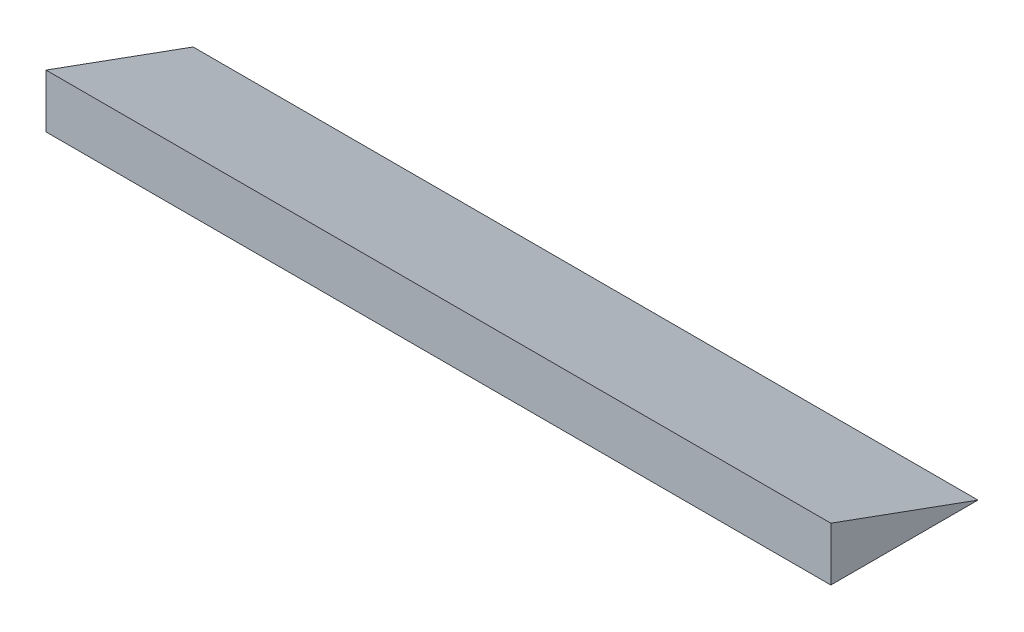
from build123d import *

# Parameters (mm, degrees)
BOSS_EXTRU_1_DEPTH      = 1600
ESQUISSE2_R             = 5
ENL_V_MAT_EXTRU_1_DEPTH = 10


with BuildPart() as part:
    # Esquisse1 → Boss.-Extru.1 (new body)
    with BuildSketch(Plane(origin=(0, 0, 0), x_dir=(0, 0, -1), z_dir=(1, 0, 0))):
        Polygon((0, 0), (300, 0), (0, 109.19107028), align=None)
    extrude(amount=BOSS_EXTRU_1_DEPTH)

    # Esquisse2 → Enl_v. mat.-Extru.1 (cut)
    with BuildSketch(Plane.XZ):
        with Locations(Location((550, -150, 0), (0, 0, 270))):
            Circle(ESQUISSE2_R)
        with Locations(Location((1050, -150, 0), (0, 0, 90))):
            Circle(ESQUISSE2_R)
    extrude(amount=-ENL_V_MAT_EXTRU_1_DEPTH, mode=Mode.SUBTRACT)


solid = part.part
